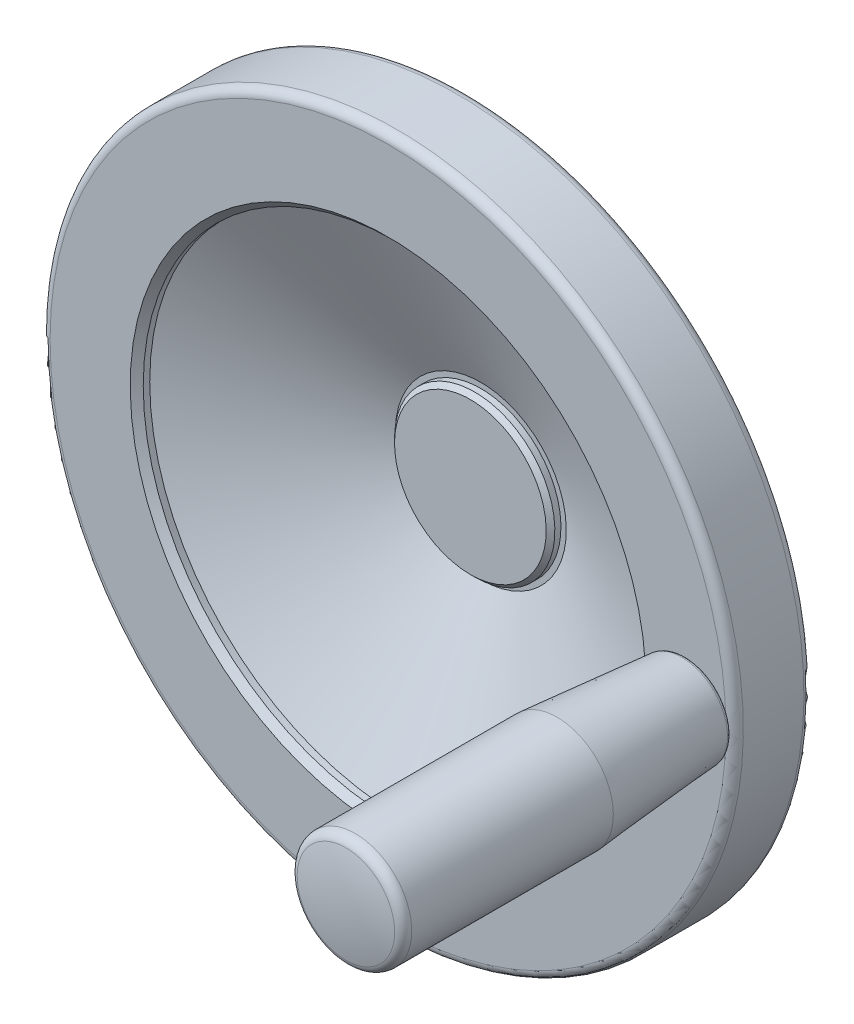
ISO-10303-21;
HEADER;
FILE_DESCRIPTION(('STEP AP214'),'2;1');
FILE_NAME('part.step','',(''),(''),'','','');
FILE_SCHEMA(('AUTOMOTIVE_DESIGN { 1 0 10303 214 1 1 1 1 }'));
ENDSEC;
DATA;
#1=APPLICATION_CONTEXT('core data for automotive mechanical design processes');
#2=APPLICATION_PROTOCOL_DEFINITION('international standard','automotive_design',2000,#1);
#3=PRODUCT_CONTEXT('',#1,'mechanical');
#4=PRODUCT('Part','Part','',(#3));
#5=PRODUCT_RELATED_PRODUCT_CATEGORY('part','',(#4));
#6=PRODUCT_DEFINITION_FORMATION('','',#4);
#7=PRODUCT_DEFINITION_CONTEXT('part definition',#1,'design');
#8=PRODUCT_DEFINITION('design','',#6,#7);
#9=PRODUCT_DEFINITION_SHAPE('','',#8);
#10=(LENGTH_UNIT() NAMED_UNIT(*) SI_UNIT(.MILLI.,.METRE.));
#11=(NAMED_UNIT(*) PLANE_ANGLE_UNIT() SI_UNIT($,.RADIAN.));
#12=(NAMED_UNIT(*) SI_UNIT($,.STERADIAN.) SOLID_ANGLE_UNIT());
#13=UNCERTAINTY_MEASURE_WITH_UNIT(LENGTH_MEASURE(1.E-05),#10,'distance_accuracy_value','');
#14=(GEOMETRIC_REPRESENTATION_CONTEXT(3) GLOBAL_UNCERTAINTY_ASSIGNED_CONTEXT((#13)) GLOBAL_UNIT_ASSIGNED_CONTEXT((#10,
#11,#12)) REPRESENTATION_CONTEXT('',''));
#15=CARTESIAN_POINT('',(0.,0.,0.));
#16=DIRECTION('',(0.,0.,1.));
#17=DIRECTION('',(1.,0.,0.));
#18=AXIS2_PLACEMENT_3D('',#15,#16,#17);
#19=CARTESIAN_POINT('',(0.,0.,60.999999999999));
#20=DIRECTION('',(0.,0.,1.));
#21=DIRECTION('',(0.,-1.,0.));
#22=AXIS2_PLACEMENT_3D('',#19,#20,#21);
#23=CYLINDRICAL_SURFACE('',#22,18.5000000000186);
#24=CARTESIAN_POINT('',(0.,0.,31.));
#25=DIRECTION('',(0.,0.,1.));
#26=DIRECTION('',(0.,-1.,0.));
#27=AXIS2_PLACEMENT_3D('',#24,#25,#26);
#28=CIRCLE('',#27,18.5000000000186);
#29=CARTESIAN_POINT('',(0.,-18.5000000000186,31.));
#30=VERTEX_POINT('',#29);
#31=EDGE_CURVE('E9',#30,#30,#28,.T.);
#32=ORIENTED_EDGE('',*,*,#31,.F.);
#33=EDGE_LOOP('',(#32));
#34=FACE_BOUND('',#33,.T.);
#35=CARTESIAN_POINT('',(0.,0.,29.5906852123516));
#36=DIRECTION('',(0.,0.,1.));
#37=DIRECTION('',(0.,-1.,0.));
#38=AXIS2_PLACEMENT_3D('',#35,#36,#37);
#39=CIRCLE('',#38,18.5000000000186);
#40=CARTESIAN_POINT('',(0.,-18.5000000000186,29.5906852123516));
#41=VERTEX_POINT('',#40);
#42=EDGE_CURVE('E87',#41,#41,#39,.T.);
#43=ORIENTED_EDGE('',*,*,#42,.T.);
#44=EDGE_LOOP('',(#43));
#45=FACE_BOUND('',#44,.T.);
#46=ADVANCED_FACE('F14',(#34,#45),#23,.T.);
#47=CARTESIAN_POINT('',(0.,0.,32.));
#48=DIRECTION('',(0.,0.,-1.));
#49=DIRECTION('',(0.,1.,0.));
#50=AXIS2_PLACEMENT_3D('',#47,#48,#49);
#51=CONICAL_SURFACE('',#50,17.5000000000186,0.785398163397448);
#52=ORIENTED_EDGE('',*,*,#31,.T.);
#53=EDGE_LOOP('',(#52));
#54=FACE_BOUND('',#53,.T.);
#55=CARTESIAN_POINT('',(0.,0.,32.));
#56=DIRECTION('',(0.,0.,1.));
#57=DIRECTION('',(0.,-1.,0.));
#58=AXIS2_PLACEMENT_3D('',#55,#56,#57);
#59=CIRCLE('',#58,17.5000000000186);
#60=CARTESIAN_POINT('',(0.,-17.5000000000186,32.));
#61=VERTEX_POINT('',#60);
#62=EDGE_CURVE('E20',#61,#61,#59,.T.);
#63=ORIENTED_EDGE('',*,*,#62,.F.);
#64=EDGE_LOOP('',(#63));
#65=FACE_BOUND('',#64,.T.);
#66=ADVANCED_FACE('F134',(#54,#65),#51,.T.);
#67=CARTESIAN_POINT('',(17.5000000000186,0.,32.));
#68=DIRECTION('',(0.,0.,-1.));
#69=DIRECTION('',(0.,1.,0.));
#70=AXIS2_PLACEMENT_3D('',#67,#68,#69);
#71=PLANE('',#70);
#72=ORIENTED_EDGE('',*,*,#62,.T.);
#73=EDGE_LOOP('',(#72));
#74=FACE_BOUND('',#73,.T.);
#75=ADVANCED_FACE('F27',(#74),#71,.F.);
#76=CARTESIAN_POINT('',(0.,0.,13.));
#77=DIRECTION('',(0.,0.,-1.));
#78=DIRECTION('',(0.,1.,0.));
#79=AXIS2_PLACEMENT_3D('',#76,#77,#78);
#80=CONICAL_SURFACE('',#79,2.99999999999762,1.04719755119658);
#81=CARTESIAN_POINT('',(0.,0.,14.7320508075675));
#82=VERTEX_POINT('',#81);
#83=VERTEX_LOOP('',#82);
#84=FACE_BOUND('',#83,.T.);
#85=CARTESIAN_POINT('',(0.,0.,13.));
#86=DIRECTION('',(0.,0.,1.));
#87=DIRECTION('',(0.,-1.,0.));
#88=AXIS2_PLACEMENT_3D('',#85,#86,#87);
#89=CIRCLE('',#88,2.99999999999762);
#90=CARTESIAN_POINT('',(0.,-2.99999999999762,13.));
#91=VERTEX_POINT('',#90);
#92=EDGE_CURVE('E31',#91,#91,#89,.T.);
#93=ORIENTED_EDGE('',*,*,#92,.F.);
#94=EDGE_LOOP('',(#93));
#95=FACE_BOUND('',#94,.T.);
#96=ADVANCED_FACE('F23',(#84,#95),#80,.F.);
#97=CARTESIAN_POINT('',(0.,0.,60.999999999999));
#98=DIRECTION('',(0.,0.,1.));
#99=DIRECTION('',(0.,-1.,0.));
#100=AXIS2_PLACEMENT_3D('',#97,#98,#99);
#101=CYLINDRICAL_SURFACE('',#100,2.99999999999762);
#102=ORIENTED_EDGE('',*,*,#92,.T.);
#103=EDGE_LOOP('',(#102));
#104=FACE_BOUND('',#103,.T.);
#105=CARTESIAN_POINT('',(0.,0.,0.));
#106=DIRECTION('',(0.,0.,1.));
#107=DIRECTION('',(0.,-1.,0.));
#108=AXIS2_PLACEMENT_3D('',#105,#106,#107);
#109=CIRCLE('',#108,2.99999999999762);
#110=CARTESIAN_POINT('',(0.,-2.99999999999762,0.));
#111=VERTEX_POINT('',#110);
#112=EDGE_CURVE('E33',#111,#111,#109,.T.);
#113=ORIENTED_EDGE('',*,*,#112,.F.);
#114=EDGE_LOOP('',(#113));
#115=FACE_BOUND('',#114,.T.);
#116=ADVANCED_FACE('F26',(#104,#115),#101,.F.);
#117=CARTESIAN_POINT('',(17.0000000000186,0.,0.));
#118=DIRECTION('',(0.,0.,-1.));
#119=DIRECTION('',(0.,1.,0.));
#120=AXIS2_PLACEMENT_3D('',#117,#118,#119);
#121=PLANE('',#120);
#122=ORIENTED_EDGE('',*,*,#112,.T.);
#123=EDGE_LOOP('',(#122));
#124=FACE_BOUND('',#123,.T.);
#125=CARTESIAN_POINT('',(0.,0.,0.));
#126=DIRECTION('',(0.,0.,1.));
#127=DIRECTION('',(0.,-1.,0.));
#128=AXIS2_PLACEMENT_3D('',#125,#126,#127);
#129=CIRCLE('',#128,17.0000000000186);
#130=CARTESIAN_POINT('',(0.,-17.0000000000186,0.));
#131=VERTEX_POINT('',#130);
#132=EDGE_CURVE('E37',#131,#131,#129,.T.);
#133=ORIENTED_EDGE('',*,*,#132,.F.);
#134=EDGE_LOOP('',(#133));
#135=FACE_BOUND('',#134,.T.);
#136=ADVANCED_FACE('F226',(#124,#135),#121,.T.);
#137=CARTESIAN_POINT('',(0.,0.,0.));
#138=DIRECTION('',(0.,0.,1.));
#139=DIRECTION('',(0.,-1.,0.));
#140=AXIS2_PLACEMENT_3D('',#137,#138,#139);
#141=CONICAL_SURFACE('',#140,17.0000000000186,0.78539816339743);
#142=CARTESIAN_POINT('',(0.,0.,1.5));
#143=DIRECTION('',(0.,0.,1.));
#144=DIRECTION('',(0.,-1.,0.));
#145=AXIS2_PLACEMENT_3D('',#142,#143,#144);
#146=CIRCLE('',#145,18.5000000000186);
#147=CARTESIAN_POINT('',(0.,-18.5000000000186,1.5));
#148=VERTEX_POINT('',#147);
#149=EDGE_CURVE('E42',#148,#148,#146,.T.);
#150=ORIENTED_EDGE('',*,*,#149,.F.);
#151=EDGE_LOOP('',(#150));
#152=FACE_BOUND('',#151,.T.);
#153=ORIENTED_EDGE('',*,*,#132,.T.);
#154=EDGE_LOOP('',(#153));
#155=FACE_BOUND('',#154,.T.);
#156=ADVANCED_FACE('F222',(#152,#155),#141,.T.);
#157=CARTESIAN_POINT('',(0.,0.,60.999999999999));
#158=DIRECTION('',(0.,0.,1.));
#159=DIRECTION('',(0.,-1.,0.));
#160=AXIS2_PLACEMENT_3D('',#157,#158,#159);
#161=CYLINDRICAL_SURFACE('',#160,18.5000000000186);
#162=CARTESIAN_POINT('',(0.,0.,17.6));
#163=DIRECTION('',(0.,0.,1.));
#164=DIRECTION('',(0.,-1.,0.));
#165=AXIS2_PLACEMENT_3D('',#162,#163,#164);
#166=CIRCLE('',#165,18.5000000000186);
#167=CARTESIAN_POINT('',(0.,-18.5000000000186,17.6));
#168=VERTEX_POINT('',#167);
#169=EDGE_CURVE('E45',#168,#168,#166,.T.);
#170=ORIENTED_EDGE('',*,*,#169,.F.);
#171=EDGE_LOOP('',(#170));
#172=FACE_BOUND('',#171,.T.);
#173=ORIENTED_EDGE('',*,*,#149,.T.);
#174=EDGE_LOOP('',(#173));
#175=FACE_BOUND('',#174,.T.);
#176=ADVANCED_FACE('F218',(#172,#175),#161,.T.);
#177=CARTESIAN_POINT('',(0.,0.,17.6));
#178=DIRECTION('',(0.,0.,1.));
#179=DIRECTION('',(0.,-1.,0.));
#180=AXIS2_PLACEMENT_3D('',#177,#178,#179);
#181=TOROIDAL_SURFACE('',#180,18.9000000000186,0.399999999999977);
#182=ORIENTED_EDGE('',*,*,#169,.T.);
#183=EDGE_LOOP('',(#182));
#184=FACE_BOUND('',#183,.T.);
#185=CARTESIAN_POINT('',(0.,0.,18.));
#186=DIRECTION('',(0.,0.,1.));
#187=DIRECTION('',(0.,-1.,0.));
#188=AXIS2_PLACEMENT_3D('',#185,#186,#187);
#189=CIRCLE('',#188,18.9000000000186);
#190=CARTESIAN_POINT('',(0.,-18.9000000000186,18.));
#191=VERTEX_POINT('',#190);
#192=EDGE_CURVE('E48',#191,#191,#189,.T.);
#193=ORIENTED_EDGE('',*,*,#192,.F.);
#194=EDGE_LOOP('',(#193));
#195=FACE_BOUND('',#194,.T.);
#196=ADVANCED_FACE('F214',(#184,#195),#181,.F.);
#197=CARTESIAN_POINT('',(18.9000000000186,0.,18.));
#198=DIRECTION('',(0.,0.,1.));
#199=DIRECTION('',(0.,-1.,0.));
#200=AXIS2_PLACEMENT_3D('',#197,#198,#199);
#201=PLANE('',#200);
#202=CARTESIAN_POINT('',(0.,0.,18.));
#203=DIRECTION('',(0.,0.,1.));
#204=DIRECTION('',(0.,-1.,0.));
#205=AXIS2_PLACEMENT_3D('',#202,#203,#204);
#206=CIRCLE('',#205,20.5000000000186);
#207=CARTESIAN_POINT('',(0.,-20.5000000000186,18.));
#208=VERTEX_POINT('',#207);
#209=EDGE_CURVE('E51',#208,#208,#206,.T.);
#210=ORIENTED_EDGE('',*,*,#209,.F.);
#211=EDGE_LOOP('',(#210));
#212=FACE_BOUND('',#211,.T.);
#213=ORIENTED_EDGE('',*,*,#192,.T.);
#214=EDGE_LOOP('',(#213));
#215=FACE_BOUND('',#214,.T.);
#216=ADVANCED_FACE('F210',(#212,#215),#201,.F.);
#217=CARTESIAN_POINT('',(0.,0.,60.999999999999));
#218=DIRECTION('',(0.,0.,1.));
#219=DIRECTION('',(0.,-1.,0.));
#220=AXIS2_PLACEMENT_3D('',#217,#218,#219);
#221=CYLINDRICAL_SURFACE('',#220,20.5000000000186);
#222=CARTESIAN_POINT('',(0.,0.,20.0588186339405));
#223=DIRECTION('',(0.,0.,1.));
#224=DIRECTION('',(0.,-1.,0.));
#225=AXIS2_PLACEMENT_3D('',#222,#223,#224);
#226=CIRCLE('',#225,20.5000000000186);
#227=CARTESIAN_POINT('',(0.,-20.5000000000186,20.0588186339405));
#228=VERTEX_POINT('',#227);
#229=EDGE_CURVE('E54',#228,#228,#226,.T.);
#230=ORIENTED_EDGE('',*,*,#229,.F.);
#231=EDGE_LOOP('',(#230));
#232=FACE_BOUND('',#231,.T.);
#233=ORIENTED_EDGE('',*,*,#209,.T.);
#234=EDGE_LOOP('',(#233));
#235=FACE_BOUND('',#234,.T.);
#236=ADVANCED_FACE('F206',(#232,#235),#221,.T.);
#237=CARTESIAN_POINT('',(0.,0.,20.0588186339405));
#238=DIRECTION('',(0.,0.,1.));
#239=DIRECTION('',(0.,-1.,0.));
#240=AXIS2_PLACEMENT_3D('',#237,#238,#239);
#241=TOROIDAL_SURFACE('',#240,25.5000000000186,5.);
#242=ORIENTED_EDGE('',*,*,#229,.T.);
#243=EDGE_LOOP('',(#242));
#244=FACE_BOUND('',#243,.T.);
#245=CARTESIAN_POINT('',(0.,0.,24.47367346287));
#246=DIRECTION('',(0.,0.,1.));
#247=DIRECTION('',(0.,-1.,0.));
#248=AXIS2_PLACEMENT_3D('',#245,#246,#247);
#249=CIRCLE('',#248,23.1528619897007);
#250=CARTESIAN_POINT('',(0.,-23.1528619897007,24.47367346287));
#251=VERTEX_POINT('',#250);
#252=EDGE_CURVE('E57',#251,#251,#249,.T.);
#253=ORIENTED_EDGE('',*,*,#252,.F.);
#254=EDGE_LOOP('',(#253));
#255=FACE_BOUND('',#254,.T.);
#256=ADVANCED_FACE('F202',(#244,#255),#241,.F.);
#257=CARTESIAN_POINT('',(0.,0.,24.47367346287));
#258=DIRECTION('',(0.,0.,1.));
#259=DIRECTION('',(0.,-1.,0.));
#260=AXIS2_PLACEMENT_3D('',#257,#258,#259);
#261=CONICAL_SURFACE('',#260,23.1528619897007,1.08215392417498);
#262=CARTESIAN_POINT('',(0.,0.,33.));
#263=DIRECTION('',(0.,0.,1.));
#264=DIRECTION('',(0.,-1.,0.));
#265=AXIS2_PLACEMENT_3D('',#262,#263,#264);
#266=CIRCLE('',#265,39.1904761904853);
#267=CARTESIAN_POINT('',(0.,-39.1904761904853,33.));
#268=VERTEX_POINT('',#267);
#269=EDGE_CURVE('E60',#268,#268,#266,.T.);
#270=ORIENTED_EDGE('',*,*,#269,.F.);
#271=EDGE_LOOP('',(#270));
#272=FACE_BOUND('',#271,.T.);
#273=ORIENTED_EDGE('',*,*,#252,.T.);
#274=EDGE_LOOP('',(#273));
#275=FACE_BOUND('',#274,.T.);
#276=ADVANCED_FACE('F198',(#272,#275),#261,.T.);
#277=CARTESIAN_POINT('',(39.1904761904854,0.,33.));
#278=DIRECTION('',(0.,0.,1.));
#279=DIRECTION('',(0.,-1.,0.));
#280=AXIS2_PLACEMENT_3D('',#277,#278,#279);
#281=PLANE('',#280);
#282=CARTESIAN_POINT('',(0.,0.,33.));
#283=DIRECTION('',(0.,0.,1.));
#284=DIRECTION('',(0.,-1.,0.));
#285=AXIS2_PLACEMENT_3D('',#282,#283,#284);
#286=CIRCLE('',#285,78.);
#287=CARTESIAN_POINT('',(0.,-78.,33.));
#288=VERTEX_POINT('',#287);
#289=EDGE_CURVE('E63',#288,#288,#286,.T.);
#290=ORIENTED_EDGE('',*,*,#289,.F.);
#291=EDGE_LOOP('',(#290));
#292=FACE_BOUND('',#291,.T.);
#293=ORIENTED_EDGE('',*,*,#269,.T.);
#294=EDGE_LOOP('',(#293));
#295=FACE_BOUND('',#294,.T.);
#296=ADVANCED_FACE('F192',(#292,#295),#281,.F.);
#297=CARTESIAN_POINT('',(0.,0.,35.));
#298=DIRECTION('',(0.,0.,1.));
#299=DIRECTION('',(0.,-1.,0.));
#300=AXIS2_PLACEMENT_3D('',#297,#298,#299);
#301=TOROIDAL_SURFACE('',#300,78.,2.);
#302=CARTESIAN_POINT('',(0.,0.,35.));
#303=DIRECTION('',(0.,0.,1.));
#304=DIRECTION('',(0.,-1.,0.));
#305=AXIS2_PLACEMENT_3D('',#302,#303,#304);
#306=CIRCLE('',#305,80.);
#307=CARTESIAN_POINT('',(0.,-80.,35.));
#308=VERTEX_POINT('',#307);
#309=EDGE_CURVE('E66',#308,#308,#306,.T.);
#310=ORIENTED_EDGE('',*,*,#309,.F.);
#311=EDGE_LOOP('',(#310));
#312=FACE_BOUND('',#311,.T.);
#313=ORIENTED_EDGE('',*,*,#289,.T.);
#314=EDGE_LOOP('',(#313));
#315=FACE_BOUND('',#314,.T.);
#316=ADVANCED_FACE('F185',(#312,#315),#301,.T.);
#317=CARTESIAN_POINT('',(0.,0.,60.999999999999));
#318=DIRECTION('',(0.,0.,1.));
#319=DIRECTION('',(0.,-1.,0.));
#320=AXIS2_PLACEMENT_3D('',#317,#318,#319);
#321=CYLINDRICAL_SURFACE('',#320,80.);
#322=ORIENTED_EDGE('',*,*,#309,.T.);
#323=EDGE_LOOP('',(#322));
#324=FACE_BOUND('',#323,.T.);
#325=CARTESIAN_POINT('',(0.,0.,49.));
#326=DIRECTION('',(0.,0.,1.));
#327=DIRECTION('',(0.,-1.,0.));
#328=AXIS2_PLACEMENT_3D('',#325,#326,#327);
#329=CIRCLE('',#328,80.);
#330=CARTESIAN_POINT('',(0.,-80.,49.));
#331=VERTEX_POINT('',#330);
#332=EDGE_CURVE('E69',#331,#331,#329,.T.);
#333=ORIENTED_EDGE('',*,*,#332,.F.);
#334=EDGE_LOOP('',(#333));
#335=FACE_BOUND('',#334,.T.);
#336=ADVANCED_FACE('F180',(#324,#335),#321,.T.);
#337=CARTESIAN_POINT('',(0.,0.,49.));
#338=DIRECTION('',(0.,0.,1.));
#339=DIRECTION('',(0.,-1.,0.));
#340=AXIS2_PLACEMENT_3D('',#337,#338,#339);
#341=TOROIDAL_SURFACE('',#340,78.,2.);
#342=CARTESIAN_POINT('',(0.,0.,51.));
#343=DIRECTION('',(0.,0.,1.));
#344=DIRECTION('',(0.,-1.,0.));
#345=AXIS2_PLACEMENT_3D('',#342,#343,#344);
#346=CIRCLE('',#345,78.);
#347=CARTESIAN_POINT('',(0.,-78.,51.));
#348=VERTEX_POINT('',#347);
#349=EDGE_CURVE('E72',#348,#348,#346,.T.);
#350=ORIENTED_EDGE('',*,*,#349,.F.);
#351=EDGE_LOOP('',(#350));
#352=FACE_BOUND('',#351,.T.);
#353=ORIENTED_EDGE('',*,*,#332,.T.);
#354=EDGE_LOOP('',(#353));
#355=FACE_BOUND('',#354,.T.);
#356=ADVANCED_FACE('F173',(#352,#355),#341,.T.);
#357=CARTESIAN_POINT('',(78.,0.,51.));
#358=DIRECTION('',(0.,0.,-1.));
#359=DIRECTION('',(0.,1.,0.));
#360=AXIS2_PLACEMENT_3D('',#357,#358,#359);
#361=PLANE('',#360);
#362=CARTESIAN_POINT('',(69.,0.,51.));
#363=DIRECTION('',(0.,0.,1.));
#364=DIRECTION('',(0.,-1.,0.));
#365=AXIS2_PLACEMENT_3D('',#362,#363,#364);
#366=CIRCLE('',#365,6.);
#367=CARTESIAN_POINT('',(69.,-6.,51.));
#368=VERTEX_POINT('',#367);
#369=EDGE_CURVE('E90',#368,#368,#366,.T.);
#370=ORIENTED_EDGE('',*,*,#369,.F.);
#371=EDGE_LOOP('',(#370));
#372=FACE_BOUND('',#371,.T.);
#373=CARTESIAN_POINT('',(0.,0.,51.));
#374=DIRECTION('',(0.,0.,1.));
#375=DIRECTION('',(0.,-1.,0.));
#376=AXIS2_PLACEMENT_3D('',#373,#374,#375);
#377=CIRCLE('',#376,59.5);
#378=CARTESIAN_POINT('',(0.,-59.5,51.));
#379=VERTEX_POINT('',#378);
#380=EDGE_CURVE('E75',#379,#379,#377,.T.);
#381=ORIENTED_EDGE('',*,*,#380,.F.);
#382=EDGE_LOOP('',(#381));
#383=FACE_BOUND('',#382,.T.);
#384=ORIENTED_EDGE('',*,*,#349,.T.);
#385=EDGE_LOOP('',(#384));
#386=FACE_BOUND('',#385,.T.);
#387=ADVANCED_FACE('F167',(#372,#383,#386),#361,.F.);
#388=CARTESIAN_POINT('',(0.,0.,51.));
#389=DIRECTION('',(0.,0.,1.));
#390=DIRECTION('',(0.,-1.,0.));
#391=AXIS2_PLACEMENT_3D('',#388,#389,#390);
#392=CONICAL_SURFACE('',#391,59.5,0.785398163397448);
#393=CARTESIAN_POINT('',(0.,0.,49.5));
#394=DIRECTION('',(0.,0.,1.));
#395=DIRECTION('',(0.,-1.,0.));
#396=AXIS2_PLACEMENT_3D('',#393,#394,#395);
#397=CIRCLE('',#396,58.);
#398=CARTESIAN_POINT('',(0.,-58.,49.5));
#399=VERTEX_POINT('',#398);
#400=EDGE_CURVE('E78',#399,#399,#397,.T.);
#401=ORIENTED_EDGE('',*,*,#400,.F.);
#402=EDGE_LOOP('',(#401));
#403=FACE_BOUND('',#402,.T.);
#404=ORIENTED_EDGE('',*,*,#380,.T.);
#405=EDGE_LOOP('',(#404));
#406=FACE_BOUND('',#405,.T.);
#407=ADVANCED_FACE('F161',(#403,#406),#392,.F.);
#408=CARTESIAN_POINT('',(0.,0.,60.999999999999));
#409=DIRECTION('',(0.,0.,1.));
#410=DIRECTION('',(0.,-1.,0.));
#411=AXIS2_PLACEMENT_3D('',#408,#409,#410);
#412=CYLINDRICAL_SURFACE('',#411,58.);
#413=CARTESIAN_POINT('',(0.,0.,48.));
#414=DIRECTION('',(0.,0.,1.));
#415=DIRECTION('',(0.,-1.,0.));
#416=AXIS2_PLACEMENT_3D('',#413,#414,#415);
#417=CIRCLE('',#416,58.);
#418=CARTESIAN_POINT('',(0.,-58.,48.));
#419=VERTEX_POINT('',#418);
#420=EDGE_CURVE('E81',#419,#419,#417,.T.);
#421=ORIENTED_EDGE('',*,*,#420,.F.);
#422=EDGE_LOOP('',(#421));
#423=FACE_BOUND('',#422,.T.);
#424=ORIENTED_EDGE('',*,*,#400,.T.);
#425=EDGE_LOOP('',(#424));
#426=FACE_BOUND('',#425,.T.);
#427=ADVANCED_FACE('F155',(#423,#426),#412,.F.);
#428=CARTESIAN_POINT('',(0.,0.,48.));
#429=DIRECTION('',(0.,0.,1.));
#430=DIRECTION('',(0.,-1.,0.));
#431=AXIS2_PLACEMENT_3D('',#428,#429,#430);
#432=CONICAL_SURFACE('',#431,58.,1.12245364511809);
#433=CARTESIAN_POINT('',(0.,0.,29.5906852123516));
#434=DIRECTION('',(0.,0.,1.));
#435=DIRECTION('',(0.,-1.,0.));
#436=AXIS2_PLACEMENT_3D('',#433,#434,#435);
#437=CIRCLE('',#436,19.7280034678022);
#438=CARTESIAN_POINT('',(0.,-19.7280034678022,29.5906852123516));
#439=VERTEX_POINT('',#438);
#440=EDGE_CURVE('E84',#439,#439,#437,.T.);
#441=ORIENTED_EDGE('',*,*,#440,.F.);
#442=EDGE_LOOP('',(#441));
#443=FACE_BOUND('',#442,.T.);
#444=ORIENTED_EDGE('',*,*,#420,.T.);
#445=EDGE_LOOP('',(#444));
#446=FACE_BOUND('',#445,.T.);
#447=ADVANCED_FACE('F149',(#443,#446),#432,.F.);
#448=CARTESIAN_POINT('',(19.7280034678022,0.,29.5906852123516));
#449=DIRECTION('',(0.,0.,-1.));
#450=DIRECTION('',(0.,1.,0.));
#451=AXIS2_PLACEMENT_3D('',#448,#449,#450);
#452=PLANE('',#451);
#453=ORIENTED_EDGE('',*,*,#42,.F.);
#454=EDGE_LOOP('',(#453));
#455=FACE_BOUND('',#454,.T.);
#456=ORIENTED_EDGE('',*,*,#440,.T.);
#457=EDGE_LOOP('',(#456));
#458=FACE_BOUND('',#457,.T.);
#459=ADVANCED_FACE('F145',(#455,#458),#452,.F.);
#460=CARTESIAN_POINT('',(69.,0.,141.));
#461=DIRECTION('',(0.,0.,1.));
#462=DIRECTION('',(0.,-1.,0.));
#463=AXIS2_PLACEMENT_3D('',#460,#461,#462);
#464=CYLINDRICAL_SURFACE('',#463,6.);
#465=ORIENTED_EDGE('',*,*,#369,.T.);
#466=EDGE_LOOP('',(#465));
#467=FACE_BOUND('',#466,.T.);
#468=CARTESIAN_POINT('',(69.,0.,51.3));
#469=DIRECTION('',(0.,0.,1.));
#470=DIRECTION('',(0.,-1.,0.));
#471=AXIS2_PLACEMENT_3D('',#468,#469,#470);
#472=CIRCLE('',#471,6.);
#473=CARTESIAN_POINT('',(69.,-6.,51.3));
#474=VERTEX_POINT('',#473);
#475=EDGE_CURVE('E93',#474,#474,#472,.T.);
#476=ORIENTED_EDGE('',*,*,#475,.F.);
#477=EDGE_LOOP('',(#476));
#478=FACE_BOUND('',#477,.T.);
#479=ADVANCED_FACE('F148',(#467,#478),#464,.T.);
#480=CARTESIAN_POINT('',(78.5806386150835,0.,51.3));
#481=DIRECTION('',(0.,0.,-1.));
#482=DIRECTION('',(0.,1.,0.));
#483=AXIS2_PLACEMENT_3D('',#480,#481,#482);
#484=PLANE('',#483);
#485=ORIENTED_EDGE('',*,*,#475,.T.);
#486=EDGE_LOOP('',(#485));
#487=FACE_BOUND('',#486,.T.);
#488=CARTESIAN_POINT('',(69.,0.,51.3));
#489=DIRECTION('',(0.,0.,1.));
#490=DIRECTION('',(0.,-1.,0.));
#491=AXIS2_PLACEMENT_3D('',#488,#489,#490);
#492=CIRCLE('',#491,9.58063861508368);
#493=CARTESIAN_POINT('',(69.,-9.58063861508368,51.3));
#494=VERTEX_POINT('',#493);
#495=EDGE_CURVE('E96',#494,#494,#492,.T.);
#496=ORIENTED_EDGE('',*,*,#495,.F.);
#497=EDGE_LOOP('',(#496));
#498=FACE_BOUND('',#497,.T.);
#499=ADVANCED_FACE('F388',(#487,#498),#484,.T.);
#500=CARTESIAN_POINT('',(69.,0.,52.3));
#501=DIRECTION('',(0.,0.,1.));
#502=DIRECTION('',(0.,-1.,0.));
#503=AXIS2_PLACEMENT_3D('',#500,#501,#502);
#504=TOROIDAL_SURFACE('',#503,9.58063861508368,0.999999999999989);
#505=CARTESIAN_POINT('',(69.,0.,52.216121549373));
#506=DIRECTION('',(0.,0.,1.));
#507=DIRECTION('',(0.,-1.,0.));
#508=AXIS2_PLACEMENT_3D('',#505,#506,#507);
#509=CIRCLE('',#508,10.5771146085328);
#510=CARTESIAN_POINT('',(69.,-10.5771146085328,52.216121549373));
#511=VERTEX_POINT('',#510);
#512=EDGE_CURVE('E99',#511,#511,#509,.T.);
#513=ORIENTED_EDGE('',*,*,#512,.F.);
#514=EDGE_LOOP('',(#513));
#515=FACE_BOUND('',#514,.T.);
#516=ORIENTED_EDGE('',*,*,#495,.T.);
#517=EDGE_LOOP('',(#516));
#518=FACE_BOUND('',#517,.T.);
#519=ADVANCED_FACE('F130',(#515,#518),#504,.T.);
#520=CARTESIAN_POINT('',(69.,0.,52.216121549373));
#521=DIRECTION('',(0.,0.,1.));
#522=DIRECTION('',(0.,-1.,0.));
#523=AXIS2_PLACEMENT_3D('',#520,#521,#522);
#524=CONICAL_SURFACE('',#523,10.5771146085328,0.0839771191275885);
#525=CARTESIAN_POINT('',(69.,0.,81.));
#526=DIRECTION('',(0.,0.,1.));
#527=DIRECTION('',(0.,-1.,0.));
#528=AXIS2_PLACEMENT_3D('',#525,#526,#527);
#529=CIRCLE('',#528,12.9999999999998);
#530=CARTESIAN_POINT('',(69.,-12.9999999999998,81.));
#531=VERTEX_POINT('',#530);
#532=EDGE_CURVE('E102',#531,#531,#529,.T.);
#533=ORIENTED_EDGE('',*,*,#532,.F.);
#534=EDGE_LOOP('',(#533));
#535=FACE_BOUND('',#534,.T.);
#536=ORIENTED_EDGE('',*,*,#512,.T.);
#537=EDGE_LOOP('',(#536));
#538=FACE_BOUND('',#537,.T.);
#539=ADVANCED_FACE('F122',(#535,#538),#524,.T.);
#540=CARTESIAN_POINT('',(69.,0.,141.));
#541=DIRECTION('',(0.,0.,1.));
#542=DIRECTION('',(0.,-1.,0.));
#543=AXIS2_PLACEMENT_3D('',#540,#541,#542);
#544=CYLINDRICAL_SURFACE('',#543,12.9999999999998);
#545=ORIENTED_EDGE('',*,*,#532,.T.);
#546=EDGE_LOOP('',(#545));
#547=FACE_BOUND('',#546,.T.);
#548=CARTESIAN_POINT('',(69.,0.,127.524187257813));
#549=DIRECTION('',(0.,0.,1.));
#550=DIRECTION('',(0.,-1.,0.));
#551=AXIS2_PLACEMENT_3D('',#548,#549,#550);
#552=CIRCLE('',#551,12.9999999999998);
#553=CARTESIAN_POINT('',(69.,-12.9999999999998,127.524187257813));
#554=VERTEX_POINT('',#553);
#555=EDGE_CURVE('E105',#554,#554,#552,.T.);
#556=ORIENTED_EDGE('',*,*,#555,.F.);
#557=EDGE_LOOP('',(#556));
#558=FACE_BOUND('',#557,.T.);
#559=ADVANCED_FACE('F117',(#547,#558),#544,.T.);
#560=CARTESIAN_POINT('',(69.,0.,127.524187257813));
#561=DIRECTION('',(0.,0.,1.));
#562=DIRECTION('',(0.,-1.,0.));
#563=AXIS2_PLACEMENT_3D('',#560,#561,#562);
#564=TOROIDAL_SURFACE('',#563,10.7500000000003,2.24999999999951);
#565=CARTESIAN_POINT('',(69.,0.,129.716426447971));
#566=DIRECTION('',(0.,0.,1.));
#567=DIRECTION('',(0.,-1.,0.));
#568=AXIS2_PLACEMENT_3D('',#565,#566,#567);
#569=CIRCLE('',#568,11.2565445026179);
#570=CARTESIAN_POINT('',(69.,-11.2565445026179,129.716426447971));
#571=VERTEX_POINT('',#570);
#572=EDGE_CURVE('E108',#571,#571,#569,.T.);
#573=ORIENTED_EDGE('',*,*,#572,.F.);
#574=EDGE_LOOP('',(#573));
#575=FACE_BOUND('',#574,.T.);
#576=ORIENTED_EDGE('',*,*,#555,.T.);
#577=EDGE_LOOP('',(#576));
#578=FACE_BOUND('',#577,.T.);
#579=ADVANCED_FACE('F114',(#575,#578),#564,.T.);
#580=CARTESIAN_POINT('',(69.,0.,81.));
#581=DIRECTION('',(0.,-1.,0.));
#582=DIRECTION('',(0.,0.,-1.));
#583=AXIS2_PLACEMENT_3D('',#580,#581,#582);
#584=SPHERICAL_SURFACE('',#583,50.);
#585=CARTESIAN_POINT('',(69.,0.,81.));
#586=DIRECTION('',(0.,0.,1.));
#587=DIRECTION('',(0.,-1.,0.));
#588=AXIS2_PLACEMENT_3D('',#585,#586,#587);
#589=SPHERICAL_SURFACE('',#588,50.);
#590=ORIENTED_EDGE('',*,*,#572,.T.);
#591=EDGE_LOOP('',(#590));
#592=FACE_BOUND('',#591,.T.);
#593=ADVANCED_FACE('F112',(#592),#589,.T.);
#594=CLOSED_SHELL('',(#46,#66,#75,#96,#116,#136,#156,#176,#196,#216,#236,#256,#276,#296,#316,
#336,#356,#387,#407,#427,#447,#459,#479,#499,#519,#539,#559,#579,#593));
#595=MANIFOLD_SOLID_BREP('B1',#594);
#596=ADVANCED_BREP_SHAPE_REPRESENTATION('',(#18,#595),#14);
#597=SHAPE_DEFINITION_REPRESENTATION(#9,#596);
ENDSEC;
END-ISO-10303-21;
